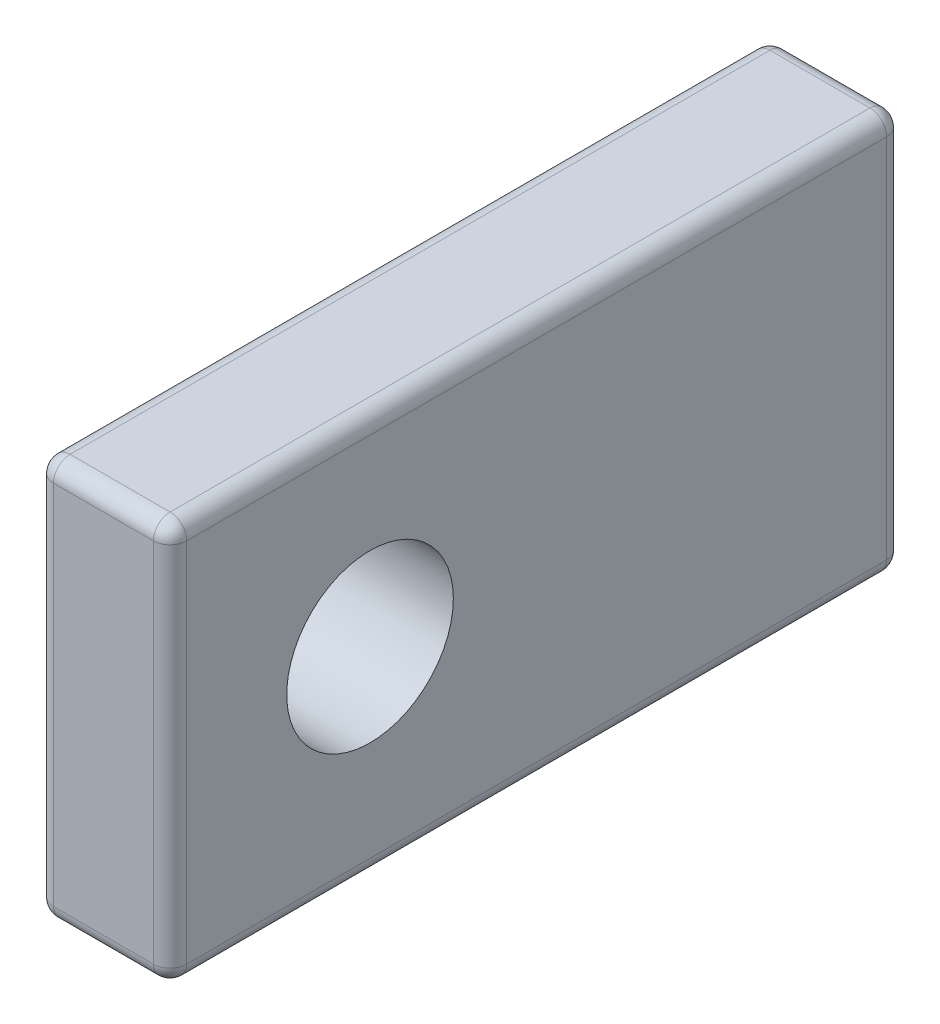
ISO-10303-21;
HEADER;
FILE_DESCRIPTION(('STEP AP214'),'2;1');
FILE_NAME('part.step','',(''),(''),'','','');
FILE_SCHEMA(('AUTOMOTIVE_DESIGN { 1 0 10303 214 1 1 1 1 }'));
ENDSEC;
DATA;
#1=APPLICATION_CONTEXT('core data for automotive mechanical design processes');
#2=APPLICATION_PROTOCOL_DEFINITION('international standard','automotive_design',2000,#1);
#3=PRODUCT_CONTEXT('',#1,'mechanical');
#4=PRODUCT('Part','Part','',(#3));
#5=PRODUCT_RELATED_PRODUCT_CATEGORY('part','',(#4));
#6=PRODUCT_DEFINITION_FORMATION('','',#4);
#7=PRODUCT_DEFINITION_CONTEXT('part definition',#1,'design');
#8=PRODUCT_DEFINITION('design','',#6,#7);
#9=PRODUCT_DEFINITION_SHAPE('','',#8);
#10=(LENGTH_UNIT() NAMED_UNIT(*) SI_UNIT(.MILLI.,.METRE.));
#11=(NAMED_UNIT(*) PLANE_ANGLE_UNIT() SI_UNIT($,.RADIAN.));
#12=(NAMED_UNIT(*) SI_UNIT($,.STERADIAN.) SOLID_ANGLE_UNIT());
#13=UNCERTAINTY_MEASURE_WITH_UNIT(LENGTH_MEASURE(1.E-05),#10,'distance_accuracy_value','');
#14=(GEOMETRIC_REPRESENTATION_CONTEXT(3) GLOBAL_UNCERTAINTY_ASSIGNED_CONTEXT((#13)) GLOBAL_UNIT_ASSIGNED_CONTEXT((#10,
#11,#12)) REPRESENTATION_CONTEXT('',''));
#15=CARTESIAN_POINT('',(0.,0.,0.));
#16=DIRECTION('',(0.,0.,1.));
#17=DIRECTION('',(1.,0.,0.));
#18=AXIS2_PLACEMENT_3D('',#15,#16,#17);
#19=CARTESIAN_POINT('',(3.17500000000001,-9.525,9.52499999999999));
#20=DIRECTION('',(1.,0.,0.));
#21=DIRECTION('',(0.,0.,-1.));
#22=AXIS2_PLACEMENT_3D('',#19,#20,#21);
#23=PLANE('',#22);
#24=DIRECTION('',(0.,0.,-1.));
#25=VECTOR('',#24,1.);
#26=CARTESIAN_POINT('',(3.17500000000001,-8.73125000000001,-25.4));
#27=LINE('',#26,#25);
#28=CARTESIAN_POINT('',(3.17500000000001,-8.73125,8.73125));
#29=VERTEX_POINT('',#28);
#30=CARTESIAN_POINT('',(3.17500000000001,-8.73125000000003,-24.6062500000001));
#31=VERTEX_POINT('',#30);
#32=EDGE_CURVE('E144',#29,#31,#27,.T.);
#33=ORIENTED_EDGE('',*,*,#32,.T.);
#34=DIRECTION('',(0.,1.,0.));
#35=VECTOR('',#34,1.);
#36=CARTESIAN_POINT('',(3.17500000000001,9.52500000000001,-24.6062500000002));
#37=LINE('',#36,#35);
#38=CARTESIAN_POINT('',(3.17500000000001,8.73125000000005,-24.6062500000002));
#39=VERTEX_POINT('',#38);
#40=EDGE_CURVE('E201',#31,#39,#37,.T.);
#41=ORIENTED_EDGE('',*,*,#40,.T.);
#42=DIRECTION('',(0.,0.,1.));
#43=VECTOR('',#42,1.);
#44=CARTESIAN_POINT('',(3.17500000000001,8.73125000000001,9.52500000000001));
#45=LINE('',#44,#43);
#46=CARTESIAN_POINT('',(3.17500000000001,8.73125000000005,8.73125));
#47=VERTEX_POINT('',#46);
#48=EDGE_CURVE('E196',#39,#47,#45,.T.);
#49=ORIENTED_EDGE('',*,*,#48,.T.);
#50=DIRECTION('',(0.,-1.,0.));
#51=VECTOR('',#50,1.);
#52=CARTESIAN_POINT('',(3.17500000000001,-9.52500000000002,8.73125000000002));
#53=LINE('',#52,#51);
#54=EDGE_CURVE('E198',#47,#29,#53,.T.);
#55=ORIENTED_EDGE('',*,*,#54,.T.);
#56=EDGE_LOOP('',(#33,#41,#49,#55));
#57=FACE_BOUND('',#56,.T.);
#58=CARTESIAN_POINT('',(3.17500000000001,0.,0.));
#59=DIRECTION('',(1.,0.,0.));
#60=DIRECTION('',(0.,0.,-1.));
#61=AXIS2_PLACEMENT_3D('',#58,#59,#60);
#62=CIRCLE('',#61,3.96875);
#63=CARTESIAN_POINT('',(3.17500000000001,0.,-3.96875000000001));
#64=VERTEX_POINT('',#63);
#65=EDGE_CURVE('E159',#64,#64,#62,.T.);
#66=ORIENTED_EDGE('',*,*,#65,.F.);
#67=EDGE_LOOP('',(#66));
#68=FACE_BOUND('',#67,.T.);
#69=ADVANCED_FACE('F38',(#57,#68),#23,.T.);
#70=CARTESIAN_POINT('',(-3.17500000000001,-9.525,9.52499999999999));
#71=DIRECTION('',(1.,0.,0.));
#72=DIRECTION('',(0.,0.,-1.));
#73=AXIS2_PLACEMENT_3D('',#70,#71,#72);
#74=PLANE('',#73);
#75=DIRECTION('',(0.,0.,1.));
#76=VECTOR('',#75,1.);
#77=CARTESIAN_POINT('',(-3.17500000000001,8.73125000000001,9.52500000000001));
#78=LINE('',#77,#76);
#79=CARTESIAN_POINT('',(-3.17500000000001,8.73125000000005,8.73125));
#80=VERTEX_POINT('',#79);
#81=CARTESIAN_POINT('',(-3.17500000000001,8.73125000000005,-24.6062500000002));
#82=VERTEX_POINT('',#81);
#83=EDGE_CURVE('E171',#80,#82,#78,.F.);
#84=ORIENTED_EDGE('',*,*,#83,.T.);
#85=DIRECTION('',(0.,1.,0.));
#86=VECTOR('',#85,1.);
#87=CARTESIAN_POINT('',(-3.17500000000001,-9.52500000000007,-24.6062500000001));
#88=LINE('',#87,#86);
#89=CARTESIAN_POINT('',(-3.17500000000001,-8.73125000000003,-24.6062500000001));
#90=VERTEX_POINT('',#89);
#91=EDGE_CURVE('E176',#82,#90,#88,.F.);
#92=ORIENTED_EDGE('',*,*,#91,.T.);
#93=DIRECTION('',(0.,0.,-1.));
#94=VECTOR('',#93,1.);
#95=CARTESIAN_POINT('',(-3.17500000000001,-8.73125000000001,9.52499999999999));
#96=LINE('',#95,#94);
#97=CARTESIAN_POINT('',(-3.17500000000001,-8.73125,8.73125));
#98=VERTEX_POINT('',#97);
#99=EDGE_CURVE('E173',#90,#98,#96,.F.);
#100=ORIENTED_EDGE('',*,*,#99,.T.);
#101=DIRECTION('',(0.,-1.,0.));
#102=VECTOR('',#101,1.);
#103=CARTESIAN_POINT('',(-3.17500000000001,-9.52500000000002,8.73125000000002));
#104=LINE('',#103,#102);
#105=EDGE_CURVE('E169',#98,#80,#104,.F.);
#106=ORIENTED_EDGE('',*,*,#105,.T.);
#107=EDGE_LOOP('',(#84,#92,#100,#106));
#108=FACE_BOUND('',#107,.T.);
#109=CARTESIAN_POINT('',(-3.17500000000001,0.,0.));
#110=DIRECTION('',(1.,0.,0.));
#111=DIRECTION('',(0.,0.,-1.));
#112=AXIS2_PLACEMENT_3D('',#109,#110,#111);
#113=CIRCLE('',#112,3.96875);
#114=CARTESIAN_POINT('',(-3.17500000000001,0.,-3.96875000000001));
#115=VERTEX_POINT('',#114);
#116=EDGE_CURVE('E162',#115,#115,#113,.T.);
#117=ORIENTED_EDGE('',*,*,#116,.T.);
#118=EDGE_LOOP('',(#117));
#119=FACE_BOUND('',#118,.T.);
#120=ADVANCED_FACE('F270',(#108,#119),#74,.F.);
#121=CARTESIAN_POINT('',(3.17500000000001,9.52499999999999,9.52500000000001));
#122=DIRECTION('',(0.,0.,-1.));
#123=DIRECTION('',(0.,1.,0.));
#124=AXIS2_PLACEMENT_3D('',#121,#122,#123);
#125=PLANE('',#124);
#126=DIRECTION('',(0.,-1.,0.));
#127=VECTOR('',#126,1.);
#128=CARTESIAN_POINT('',(-2.38125,9.52499999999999,9.52500000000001));
#129=LINE('',#128,#127);
#130=CARTESIAN_POINT('',(-2.38125,8.73125000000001,9.52500000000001));
#131=VERTEX_POINT('',#130);
#132=CARTESIAN_POINT('',(-2.38125,-8.73125000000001,9.52499999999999));
#133=VERTEX_POINT('',#132);
#134=EDGE_CURVE('E47',#131,#133,#129,.T.);
#135=ORIENTED_EDGE('',*,*,#134,.T.);
#136=DIRECTION('',(-1.,0.,0.));
#137=VECTOR('',#136,1.);
#138=CARTESIAN_POINT('',(3.17500000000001,-8.73125000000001,9.52499999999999));
#139=LINE('',#138,#137);
#140=CARTESIAN_POINT('',(2.38125,-8.73125000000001,9.52499999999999));
#141=VERTEX_POINT('',#140);
#142=EDGE_CURVE('E11',#133,#141,#139,.F.);
#143=ORIENTED_EDGE('',*,*,#142,.T.);
#144=DIRECTION('',(0.,-1.,0.));
#145=VECTOR('',#144,1.);
#146=CARTESIAN_POINT('',(2.38125,9.52499999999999,9.52500000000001));
#147=LINE('',#146,#145);
#148=CARTESIAN_POINT('',(2.38125,8.73125000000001,9.52500000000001));
#149=VERTEX_POINT('',#148);
#150=EDGE_CURVE('E206',#141,#149,#147,.F.);
#151=ORIENTED_EDGE('',*,*,#150,.T.);
#152=DIRECTION('',(-1.,0.,0.));
#153=VECTOR('',#152,1.);
#154=CARTESIAN_POINT('',(3.17500000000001,8.73125000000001,9.52500000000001));
#155=LINE('',#154,#153);
#156=EDGE_CURVE('E204',#149,#131,#155,.T.);
#157=ORIENTED_EDGE('',*,*,#156,.T.);
#158=EDGE_LOOP('',(#135,#143,#151,#157));
#159=FACE_BOUND('',#158,.T.);
#160=ADVANCED_FACE('F292',(#159),#125,.F.);
#161=CARTESIAN_POINT('',(3.17500000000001,-9.525,9.52499999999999));
#162=DIRECTION('',(0.,1.,0.));
#163=DIRECTION('',(0.,0.,1.));
#164=AXIS2_PLACEMENT_3D('',#161,#162,#163);
#165=PLANE('',#164);
#166=DIRECTION('',(-1.,0.,0.));
#167=VECTOR('',#166,1.);
#168=CARTESIAN_POINT('',(3.17500000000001,-9.52500000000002,8.73125000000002));
#169=LINE('',#168,#167);
#170=CARTESIAN_POINT('',(2.38125,-9.52500000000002,8.73125000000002));
#171=VERTEX_POINT('',#170);
#172=CARTESIAN_POINT('',(-2.38125,-9.52500000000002,8.73125000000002));
#173=VERTEX_POINT('',#172);
#174=EDGE_CURVE('E132',#171,#173,#169,.T.);
#175=ORIENTED_EDGE('',*,*,#174,.T.);
#176=DIRECTION('',(0.,0.,-1.));
#177=VECTOR('',#176,1.);
#178=CARTESIAN_POINT('',(-2.38125,-9.525,9.52499999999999));
#179=LINE('',#178,#177);
#180=CARTESIAN_POINT('',(-2.38125,-9.52500000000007,-24.6062500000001));
#181=VERTEX_POINT('',#180);
#182=EDGE_CURVE('E167',#173,#181,#179,.T.);
#183=ORIENTED_EDGE('',*,*,#182,.T.);
#184=DIRECTION('',(-1.,0.,0.));
#185=VECTOR('',#184,1.);
#186=CARTESIAN_POINT('',(3.17500000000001,-9.52500000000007,-24.6062500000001));
#187=LINE('',#186,#185);
#188=CARTESIAN_POINT('',(2.38125,-9.52500000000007,-24.6062500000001));
#189=VERTEX_POINT('',#188);
#190=EDGE_CURVE('E135',#181,#189,#187,.F.);
#191=ORIENTED_EDGE('',*,*,#190,.T.);
#192=DIRECTION('',(0.,0.,-1.));
#193=VECTOR('',#192,1.);
#194=CARTESIAN_POINT('',(2.38125,-9.525,9.52499999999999));
#195=LINE('',#194,#193);
#196=EDGE_CURVE('E128',#189,#171,#195,.F.);
#197=ORIENTED_EDGE('',*,*,#196,.T.);
#198=EDGE_LOOP('',(#175,#183,#191,#197));
#199=FACE_BOUND('',#198,.T.);
#200=ADVANCED_FACE('F130',(#199),#165,.F.);
#201=CARTESIAN_POINT('',(3.17500000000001,9.52500000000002,-25.4000000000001));
#202=DIRECTION('',(0.,0.,1.));
#203=DIRECTION('',(0.,-1.,0.));
#204=AXIS2_PLACEMENT_3D('',#201,#202,#203);
#205=PLANE('',#204);
#206=DIRECTION('',(-1.,0.,0.));
#207=VECTOR('',#206,1.);
#208=CARTESIAN_POINT('',(3.17500000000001,-8.73125000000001,-25.4));
#209=LINE('',#208,#207);
#210=CARTESIAN_POINT('',(2.38125,-8.73125000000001,-25.4));
#211=VERTEX_POINT('',#210);
#212=CARTESIAN_POINT('',(-2.38125,-8.73125000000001,-25.4));
#213=VERTEX_POINT('',#212);
#214=EDGE_CURVE('E182',#211,#213,#209,.T.);
#215=ORIENTED_EDGE('',*,*,#214,.T.);
#216=DIRECTION('',(0.,1.,0.));
#217=VECTOR('',#216,1.);
#218=CARTESIAN_POINT('',(-2.38125,9.52500000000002,-25.4000000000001));
#219=LINE('',#218,#217);
#220=CARTESIAN_POINT('',(-2.38125,8.73125000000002,-25.4000000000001));
#221=VERTEX_POINT('',#220);
#222=EDGE_CURVE('E185',#213,#221,#219,.T.);
#223=ORIENTED_EDGE('',*,*,#222,.T.);
#224=DIRECTION('',(-1.,0.,0.));
#225=VECTOR('',#224,1.);
#226=CARTESIAN_POINT('',(3.17500000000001,8.73125000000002,-25.4000000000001));
#227=LINE('',#226,#225);
#228=CARTESIAN_POINT('',(2.38125,8.73125000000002,-25.4000000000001));
#229=VERTEX_POINT('',#228);
#230=EDGE_CURVE('E180',#221,#229,#227,.F.);
#231=ORIENTED_EDGE('',*,*,#230,.T.);
#232=DIRECTION('',(0.,1.,0.));
#233=VECTOR('',#232,1.);
#234=CARTESIAN_POINT('',(2.38125,-9.52500000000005,-25.4));
#235=LINE('',#234,#233);
#236=EDGE_CURVE('E178',#229,#211,#235,.F.);
#237=ORIENTED_EDGE('',*,*,#236,.T.);
#238=EDGE_LOOP('',(#215,#223,#231,#237));
#239=FACE_BOUND('',#238,.T.);
#240=ADVANCED_FACE('F283',(#239),#205,.F.);
#241=CARTESIAN_POINT('',(3.17500000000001,9.52499999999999,9.52500000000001));
#242=DIRECTION('',(0.,-1.,0.));
#243=DIRECTION('',(0.,0.,-1.));
#244=AXIS2_PLACEMENT_3D('',#241,#242,#243);
#245=PLANE('',#244);
#246=DIRECTION('',(0.,0.,1.));
#247=VECTOR('',#246,1.);
#248=CARTESIAN_POINT('',(2.38125,9.52500000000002,-25.4000000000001));
#249=LINE('',#248,#247);
#250=CARTESIAN_POINT('',(2.38125,9.52500000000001,8.7312499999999));
#251=VERTEX_POINT('',#250);
#252=CARTESIAN_POINT('',(2.38125,9.52500000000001,-24.6062500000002));
#253=VERTEX_POINT('',#252);
#254=EDGE_CURVE('E187',#251,#253,#249,.F.);
#255=ORIENTED_EDGE('',*,*,#254,.T.);
#256=DIRECTION('',(-1.,0.,0.));
#257=VECTOR('',#256,1.);
#258=CARTESIAN_POINT('',(3.17500000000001,9.52500000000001,-24.6062500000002));
#259=LINE('',#258,#257);
#260=CARTESIAN_POINT('',(-2.38125,9.52500000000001,-24.6062500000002));
#261=VERTEX_POINT('',#260);
#262=EDGE_CURVE('E193',#253,#261,#259,.T.);
#263=ORIENTED_EDGE('',*,*,#262,.T.);
#264=DIRECTION('',(0.,0.,1.));
#265=VECTOR('',#264,1.);
#266=CARTESIAN_POINT('',(-2.38125,9.52499999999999,9.52500000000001));
#267=LINE('',#266,#265);
#268=CARTESIAN_POINT('',(-2.38125,9.52500000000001,8.7312499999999));
#269=VERTEX_POINT('',#268);
#270=EDGE_CURVE('E191',#261,#269,#267,.T.);
#271=ORIENTED_EDGE('',*,*,#270,.T.);
#272=DIRECTION('',(-1.,0.,0.));
#273=VECTOR('',#272,1.);
#274=CARTESIAN_POINT('',(3.17500000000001,9.52500000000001,8.7312499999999));
#275=LINE('',#274,#273);
#276=EDGE_CURVE('E189',#269,#251,#275,.F.);
#277=ORIENTED_EDGE('',*,*,#276,.T.);
#278=EDGE_LOOP('',(#255,#263,#271,#277));
#279=FACE_BOUND('',#278,.T.);
#280=ADVANCED_FACE('F274',(#279),#245,.F.);
#281=CARTESIAN_POINT('',(3.17500000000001,0.,0.));
#282=DIRECTION('',(-1.,0.,0.));
#283=DIRECTION('',(0.,0.,1.));
#284=AXIS2_PLACEMENT_3D('',#281,#282,#283);
#285=CYLINDRICAL_SURFACE('',#284,3.96875);
#286=ORIENTED_EDGE('',*,*,#65,.T.);
#287=EDGE_LOOP('',(#286));
#288=FACE_BOUND('',#287,.T.);
#289=ORIENTED_EDGE('',*,*,#116,.F.);
#290=EDGE_LOOP('',(#289));
#291=FACE_BOUND('',#290,.T.);
#292=ADVANCED_FACE('F272',(#288,#291),#285,.F.);
#293=CARTESIAN_POINT('',(2.38125,8.73125000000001,9.52500000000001));
#294=DIRECTION('',(0.,0.,-1.));
#295=DIRECTION('',(0.,1.,0.));
#296=AXIS2_PLACEMENT_3D('',#293,#294,#295);
#297=CYLINDRICAL_SURFACE('',#296,0.79375);
#298=CARTESIAN_POINT('',(2.38125,8.73125000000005,8.73125));
#299=DIRECTION('',(0.,0.,1.));
#300=DIRECTION('',(1.,0.,0.));
#301=AXIS2_PLACEMENT_3D('',#298,#299,#300);
#302=CIRCLE('',#301,0.79375);
#303=EDGE_CURVE('E42',#47,#251,#302,.T.);
#304=ORIENTED_EDGE('',*,*,#303,.F.);
#305=ORIENTED_EDGE('',*,*,#48,.F.);
#306=CARTESIAN_POINT('',(2.38125,8.73125000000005,-24.6062500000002));
#307=DIRECTION('',(0.,0.,-1.));
#308=DIRECTION('',(-1.,0.,0.));
#309=AXIS2_PLACEMENT_3D('',#306,#307,#308);
#310=CIRCLE('',#309,0.79375);
#311=EDGE_CURVE('E255',#253,#39,#310,.T.);
#312=ORIENTED_EDGE('',*,*,#311,.F.);
#313=ORIENTED_EDGE('',*,*,#254,.F.);
#314=EDGE_LOOP('',(#304,#305,#312,#313));
#315=FACE_BOUND('',#314,.T.);
#316=ADVANCED_FACE('F40',(#315),#297,.T.);
#317=CARTESIAN_POINT('',(2.38125,8.73125000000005,8.73125));
#318=DIRECTION('',(0.,0.,1.));
#319=DIRECTION('',(1.,0.,0.));
#320=AXIS2_PLACEMENT_3D('',#317,#318,#319);
#321=SPHERICAL_SURFACE('',#320,0.79375);
#322=CARTESIAN_POINT('',(2.38125,8.73125000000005,8.73125));
#323=DIRECTION('',(0.,1.,0.));
#324=DIRECTION('',(-1.,0.,0.));
#325=AXIS2_PLACEMENT_3D('',#322,#323,#324);
#326=CIRCLE('',#325,0.79375);
#327=EDGE_CURVE('E250',#47,#149,#326,.F.);
#328=ORIENTED_EDGE('',*,*,#327,.F.);
#329=ORIENTED_EDGE('',*,*,#303,.T.);
#330=CARTESIAN_POINT('',(2.38125,8.73125000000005,8.73125));
#331=DIRECTION('',(1.,0.,0.));
#332=DIRECTION('',(0.,0.,-1.));
#333=AXIS2_PLACEMENT_3D('',#330,#331,#332);
#334=CIRCLE('',#333,0.79375);
#335=EDGE_CURVE('E253',#149,#251,#334,.F.);
#336=ORIENTED_EDGE('',*,*,#335,.F.);
#337=EDGE_LOOP('',(#328,#329,#336));
#338=FACE_BOUND('',#337,.T.);
#339=ADVANCED_FACE('F281',(#338),#321,.T.);
#340=CARTESIAN_POINT('',(2.38125,8.73125000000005,-24.6062500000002));
#341=DIRECTION('',(0.,0.,1.));
#342=DIRECTION('',(1.,0.,0.));
#343=AXIS2_PLACEMENT_3D('',#340,#341,#342);
#344=SPHERICAL_SURFACE('',#343,0.79375);
#345=CARTESIAN_POINT('',(2.38125,8.73125000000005,-24.6062500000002));
#346=DIRECTION('',(1.,0.,0.));
#347=DIRECTION('',(0.,0.,-1.));
#348=AXIS2_PLACEMENT_3D('',#345,#346,#347);
#349=CIRCLE('',#348,0.79375);
#350=EDGE_CURVE('E245',#253,#229,#349,.F.);
#351=ORIENTED_EDGE('',*,*,#350,.F.);
#352=ORIENTED_EDGE('',*,*,#311,.T.);
#353=CARTESIAN_POINT('',(2.38125,8.73125000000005,-24.6062500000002));
#354=DIRECTION('',(0.,1.,0.));
#355=DIRECTION('',(0.,0.,1.));
#356=AXIS2_PLACEMENT_3D('',#353,#354,#355);
#357=CIRCLE('',#356,0.79375);
#358=EDGE_CURVE('E248',#229,#39,#357,.F.);
#359=ORIENTED_EDGE('',*,*,#358,.F.);
#360=EDGE_LOOP('',(#351,#352,#359));
#361=FACE_BOUND('',#360,.T.);
#362=ADVANCED_FACE('F365',(#361),#344,.T.);
#363=CARTESIAN_POINT('',(3.17500000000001,8.73125000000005,8.73125));
#364=DIRECTION('',(-1.,0.,0.));
#365=DIRECTION('',(0.,0.,1.));
#366=AXIS2_PLACEMENT_3D('',#363,#364,#365);
#367=CYLINDRICAL_SURFACE('',#366,0.79375);
#368=ORIENTED_EDGE('',*,*,#335,.T.);
#369=ORIENTED_EDGE('',*,*,#276,.F.);
#370=CARTESIAN_POINT('',(-2.38125,8.73125000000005,8.73125));
#371=DIRECTION('',(-1.,0.,0.));
#372=DIRECTION('',(0.,0.,1.));
#373=AXIS2_PLACEMENT_3D('',#370,#371,#372);
#374=CIRCLE('',#373,0.79375);
#375=EDGE_CURVE('E239',#131,#269,#374,.T.);
#376=ORIENTED_EDGE('',*,*,#375,.F.);
#377=ORIENTED_EDGE('',*,*,#156,.F.);
#378=EDGE_LOOP('',(#368,#369,#376,#377));
#379=FACE_BOUND('',#378,.T.);
#380=ADVANCED_FACE('F361',(#379),#367,.T.);
#381=CARTESIAN_POINT('',(2.38125,-9.52500000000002,8.73125000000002));
#382=DIRECTION('',(0.,1.,0.));
#383=DIRECTION('',(0.,0.,1.));
#384=AXIS2_PLACEMENT_3D('',#381,#382,#383);
#385=CYLINDRICAL_SURFACE('',#384,0.79375);
#386=ORIENTED_EDGE('',*,*,#327,.T.);
#387=ORIENTED_EDGE('',*,*,#150,.F.);
#388=CARTESIAN_POINT('',(2.38125,-8.73125,8.73125));
#389=DIRECTION('',(0.,-1.,0.));
#390=DIRECTION('',(0.,0.,-1.));
#391=AXIS2_PLACEMENT_3D('',#388,#389,#390);
#392=CIRCLE('',#391,0.79375);
#393=EDGE_CURVE('E147',#29,#141,#392,.T.);
#394=ORIENTED_EDGE('',*,*,#393,.F.);
#395=ORIENTED_EDGE('',*,*,#54,.F.);
#396=EDGE_LOOP('',(#386,#387,#394,#395));
#397=FACE_BOUND('',#396,.T.);
#398=ADVANCED_FACE('F358',(#397),#385,.T.);
#399=CARTESIAN_POINT('',(2.38125,-8.73125000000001,9.52499999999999));
#400=DIRECTION('',(0.,0.,1.));
#401=DIRECTION('',(1.,0.,0.));
#402=AXIS2_PLACEMENT_3D('',#399,#400,#401);
#403=CYLINDRICAL_SURFACE('',#402,0.79375);
#404=CARTESIAN_POINT('',(2.38125,-8.73125000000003,-24.6062500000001));
#405=DIRECTION('',(0.,0.,-1.));
#406=DIRECTION('',(0.,1.,0.));
#407=AXIS2_PLACEMENT_3D('',#404,#405,#406);
#408=CIRCLE('',#407,0.79375);
#409=EDGE_CURVE('E148',#31,#189,#408,.T.);
#410=ORIENTED_EDGE('',*,*,#409,.F.);
#411=ORIENTED_EDGE('',*,*,#32,.F.);
#412=CARTESIAN_POINT('',(2.38125,-8.73125,8.73125));
#413=DIRECTION('',(0.,0.,1.));
#414=DIRECTION('',(1.,0.,0.));
#415=AXIS2_PLACEMENT_3D('',#412,#413,#414);
#416=CIRCLE('',#415,0.79375);
#417=EDGE_CURVE('E142',#171,#29,#416,.T.);
#418=ORIENTED_EDGE('',*,*,#417,.F.);
#419=ORIENTED_EDGE('',*,*,#196,.F.);
#420=EDGE_LOOP('',(#410,#411,#418,#419));
#421=FACE_BOUND('',#420,.T.);
#422=ADVANCED_FACE('F143',(#421),#403,.T.);
#423=CARTESIAN_POINT('',(2.38125,-9.52500000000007,-24.6062500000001));
#424=DIRECTION('',(0.,-1.,0.));
#425=DIRECTION('',(0.,0.,-1.));
#426=AXIS2_PLACEMENT_3D('',#423,#424,#425);
#427=CYLINDRICAL_SURFACE('',#426,0.79375);
#428=ORIENTED_EDGE('',*,*,#358,.T.);
#429=ORIENTED_EDGE('',*,*,#40,.F.);
#430=CARTESIAN_POINT('',(2.38125,-8.73125000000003,-24.6062500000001));
#431=DIRECTION('',(0.,-1.,0.));
#432=DIRECTION('',(0.,0.,-1.));
#433=AXIS2_PLACEMENT_3D('',#430,#431,#432);
#434=CIRCLE('',#433,0.79375);
#435=EDGE_CURVE('E234',#211,#31,#434,.T.);
#436=ORIENTED_EDGE('',*,*,#435,.F.);
#437=ORIENTED_EDGE('',*,*,#236,.F.);
#438=EDGE_LOOP('',(#428,#429,#436,#437));
#439=FACE_BOUND('',#438,.T.);
#440=ADVANCED_FACE('F351',(#439),#427,.T.);
#441=CARTESIAN_POINT('',(3.17500000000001,8.73125000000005,-24.6062500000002));
#442=DIRECTION('',(-1.,0.,0.));
#443=DIRECTION('',(0.,0.,1.));
#444=AXIS2_PLACEMENT_3D('',#441,#442,#443);
#445=CYLINDRICAL_SURFACE('',#444,0.79375);
#446=ORIENTED_EDGE('',*,*,#350,.T.);
#447=ORIENTED_EDGE('',*,*,#230,.F.);
#448=CARTESIAN_POINT('',(-2.38125,8.73125000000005,-24.6062500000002));
#449=DIRECTION('',(-1.,0.,0.));
#450=DIRECTION('',(0.,0.,1.));
#451=AXIS2_PLACEMENT_3D('',#448,#449,#450);
#452=CIRCLE('',#451,0.79375);
#453=EDGE_CURVE('E231',#261,#221,#452,.T.);
#454=ORIENTED_EDGE('',*,*,#453,.F.);
#455=ORIENTED_EDGE('',*,*,#262,.F.);
#456=EDGE_LOOP('',(#446,#447,#454,#455));
#457=FACE_BOUND('',#456,.T.);
#458=ADVANCED_FACE('F347',(#457),#445,.T.);
#459=CARTESIAN_POINT('',(-2.38125,8.73125000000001,9.52500000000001));
#460=DIRECTION('',(0.,0.,1.));
#461=DIRECTION('',(0.,-1.,0.));
#462=AXIS2_PLACEMENT_3D('',#459,#460,#461);
#463=CYLINDRICAL_SURFACE('',#462,0.79375);
#464=CARTESIAN_POINT('',(-2.38125,8.73125000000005,8.73125));
#465=DIRECTION('',(0.,0.,1.));
#466=DIRECTION('',(1.,0.,0.));
#467=AXIS2_PLACEMENT_3D('',#464,#465,#466);
#468=CIRCLE('',#467,0.79375);
#469=EDGE_CURVE('E242',#269,#80,#468,.T.);
#470=ORIENTED_EDGE('',*,*,#469,.F.);
#471=ORIENTED_EDGE('',*,*,#270,.F.);
#472=CARTESIAN_POINT('',(-2.38125,8.73125000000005,-24.6062500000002));
#473=DIRECTION('',(0.,0.,-1.));
#474=DIRECTION('',(0.,1.,0.));
#475=AXIS2_PLACEMENT_3D('',#472,#473,#474);
#476=CIRCLE('',#475,0.79375);
#477=EDGE_CURVE('E229',#82,#261,#476,.T.);
#478=ORIENTED_EDGE('',*,*,#477,.F.);
#479=ORIENTED_EDGE('',*,*,#83,.F.);
#480=EDGE_LOOP('',(#470,#471,#478,#479));
#481=FACE_BOUND('',#480,.T.);
#482=ADVANCED_FACE('F343',(#481),#463,.T.);
#483=CARTESIAN_POINT('',(-2.38125,8.73125000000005,8.73125));
#484=DIRECTION('',(0.,0.,1.));
#485=DIRECTION('',(1.,0.,0.));
#486=AXIS2_PLACEMENT_3D('',#483,#484,#485);
#487=SPHERICAL_SURFACE('',#486,0.79375);
#488=ORIENTED_EDGE('',*,*,#375,.T.);
#489=ORIENTED_EDGE('',*,*,#469,.T.);
#490=CARTESIAN_POINT('',(-2.38125,8.73125000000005,8.73125));
#491=DIRECTION('',(0.,1.,0.));
#492=DIRECTION('',(0.,0.,1.));
#493=AXIS2_PLACEMENT_3D('',#490,#491,#492);
#494=CIRCLE('',#493,0.79375);
#495=EDGE_CURVE('E152',#131,#80,#494,.F.);
#496=ORIENTED_EDGE('',*,*,#495,.F.);
#497=EDGE_LOOP('',(#488,#489,#496));
#498=FACE_BOUND('',#497,.T.);
#499=ADVANCED_FACE('F340',(#498),#487,.T.);
#500=CARTESIAN_POINT('',(2.38125,-8.73125,8.73125));
#501=DIRECTION('',(0.,0.,1.));
#502=DIRECTION('',(1.,0.,0.));
#503=AXIS2_PLACEMENT_3D('',#500,#501,#502);
#504=SPHERICAL_SURFACE('',#503,0.79375);
#505=ORIENTED_EDGE('',*,*,#417,.T.);
#506=ORIENTED_EDGE('',*,*,#393,.T.);
#507=CARTESIAN_POINT('',(2.38125,-8.73125,8.73125));
#508=DIRECTION('',(1.,0.,0.));
#509=DIRECTION('',(0.,0.,-1.));
#510=AXIS2_PLACEMENT_3D('',#507,#508,#509);
#511=CIRCLE('',#510,0.79375);
#512=EDGE_CURVE('E60',#171,#141,#511,.F.);
#513=ORIENTED_EDGE('',*,*,#512,.F.);
#514=EDGE_LOOP('',(#505,#506,#513));
#515=FACE_BOUND('',#514,.T.);
#516=ADVANCED_FACE('F150',(#515),#504,.T.);
#517=CARTESIAN_POINT('',(2.38125,-8.73125000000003,-24.6062500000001));
#518=DIRECTION('',(0.,0.,1.));
#519=DIRECTION('',(1.,0.,0.));
#520=AXIS2_PLACEMENT_3D('',#517,#518,#519);
#521=SPHERICAL_SURFACE('',#520,0.79375);
#522=ORIENTED_EDGE('',*,*,#435,.T.);
#523=ORIENTED_EDGE('',*,*,#409,.T.);
#524=CARTESIAN_POINT('',(2.38125,-8.73125000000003,-24.6062500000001));
#525=DIRECTION('',(1.,0.,0.));
#526=DIRECTION('',(0.,0.,-1.));
#527=AXIS2_PLACEMENT_3D('',#524,#525,#526);
#528=CIRCLE('',#527,0.79375);
#529=EDGE_CURVE('E153',#211,#189,#528,.F.);
#530=ORIENTED_EDGE('',*,*,#529,.F.);
#531=EDGE_LOOP('',(#522,#523,#530));
#532=FACE_BOUND('',#531,.T.);
#533=ADVANCED_FACE('F333',(#532),#521,.T.);
#534=CARTESIAN_POINT('',(-2.38125,8.73125000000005,-24.6062500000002));
#535=DIRECTION('',(0.,0.,1.));
#536=DIRECTION('',(1.,0.,0.));
#537=AXIS2_PLACEMENT_3D('',#534,#535,#536);
#538=SPHERICAL_SURFACE('',#537,0.79375);
#539=ORIENTED_EDGE('',*,*,#477,.T.);
#540=ORIENTED_EDGE('',*,*,#453,.T.);
#541=CARTESIAN_POINT('',(-2.38125,8.73125000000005,-24.6062500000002));
#542=DIRECTION('',(0.,1.,0.));
#543=DIRECTION('',(0.,0.,1.));
#544=AXIS2_PLACEMENT_3D('',#541,#542,#543);
#545=CIRCLE('',#544,0.79375);
#546=EDGE_CURVE('E222',#82,#221,#545,.F.);
#547=ORIENTED_EDGE('',*,*,#546,.F.);
#548=EDGE_LOOP('',(#539,#540,#547));
#549=FACE_BOUND('',#548,.T.);
#550=ADVANCED_FACE('F329',(#549),#538,.T.);
#551=CARTESIAN_POINT('',(-2.38125,9.52500000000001,8.7312499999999));
#552=DIRECTION('',(0.,-1.,0.));
#553=DIRECTION('',(0.,0.,-1.));
#554=AXIS2_PLACEMENT_3D('',#551,#552,#553);
#555=CYLINDRICAL_SURFACE('',#554,0.79375);
#556=ORIENTED_EDGE('',*,*,#495,.T.);
#557=ORIENTED_EDGE('',*,*,#105,.F.);
#558=CARTESIAN_POINT('',(-2.38125,-8.73125,8.73125));
#559=DIRECTION('',(0.,-1.,0.));
#560=DIRECTION('',(0.,0.,-1.));
#561=AXIS2_PLACEMENT_3D('',#558,#559,#560);
#562=CIRCLE('',#561,0.79375);
#563=EDGE_CURVE('E219',#133,#98,#562,.T.);
#564=ORIENTED_EDGE('',*,*,#563,.F.);
#565=ORIENTED_EDGE('',*,*,#134,.F.);
#566=EDGE_LOOP('',(#556,#557,#564,#565));
#567=FACE_BOUND('',#566,.T.);
#568=ADVANCED_FACE('F326',(#567),#555,.T.);
#569=CARTESIAN_POINT('',(3.17500000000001,-8.73125,8.73125));
#570=DIRECTION('',(-1.,0.,0.));
#571=DIRECTION('',(0.,0.,1.));
#572=AXIS2_PLACEMENT_3D('',#569,#570,#571);
#573=CYLINDRICAL_SURFACE('',#572,0.79375);
#574=ORIENTED_EDGE('',*,*,#512,.T.);
#575=ORIENTED_EDGE('',*,*,#142,.F.);
#576=CARTESIAN_POINT('',(-2.38125,-8.73125,8.73125));
#577=DIRECTION('',(-1.,0.,0.));
#578=DIRECTION('',(0.,0.,1.));
#579=AXIS2_PLACEMENT_3D('',#576,#577,#578);
#580=CIRCLE('',#579,0.79375);
#581=EDGE_CURVE('E157',#173,#133,#580,.T.);
#582=ORIENTED_EDGE('',*,*,#581,.F.);
#583=ORIENTED_EDGE('',*,*,#174,.F.);
#584=EDGE_LOOP('',(#574,#575,#582,#583));
#585=FACE_BOUND('',#584,.T.);
#586=ADVANCED_FACE('F155',(#585),#573,.T.);
#587=CARTESIAN_POINT('',(3.17500000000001,-8.73125000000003,-24.6062500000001));
#588=DIRECTION('',(-1.,0.,0.));
#589=DIRECTION('',(0.,0.,1.));
#590=AXIS2_PLACEMENT_3D('',#587,#588,#589);
#591=CYLINDRICAL_SURFACE('',#590,0.79375);
#592=ORIENTED_EDGE('',*,*,#529,.T.);
#593=ORIENTED_EDGE('',*,*,#190,.F.);
#594=CARTESIAN_POINT('',(-2.38125,-8.73125000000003,-24.6062500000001));
#595=DIRECTION('',(-1.,0.,0.));
#596=DIRECTION('',(0.,0.,1.));
#597=AXIS2_PLACEMENT_3D('',#594,#595,#596);
#598=CIRCLE('',#597,0.79375);
#599=EDGE_CURVE('E215',#213,#181,#598,.T.);
#600=ORIENTED_EDGE('',*,*,#599,.F.);
#601=ORIENTED_EDGE('',*,*,#214,.F.);
#602=EDGE_LOOP('',(#592,#593,#600,#601));
#603=FACE_BOUND('',#602,.T.);
#604=ADVANCED_FACE('F319',(#603),#591,.T.);
#605=CARTESIAN_POINT('',(-2.38125,9.52500000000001,-24.6062500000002));
#606=DIRECTION('',(0.,1.,0.));
#607=DIRECTION('',(0.,0.,1.));
#608=AXIS2_PLACEMENT_3D('',#605,#606,#607);
#609=CYLINDRICAL_SURFACE('',#608,0.79375);
#610=ORIENTED_EDGE('',*,*,#546,.T.);
#611=ORIENTED_EDGE('',*,*,#222,.F.);
#612=CARTESIAN_POINT('',(-2.38125,-8.73125000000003,-24.6062500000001));
#613=DIRECTION('',(0.,-1.,0.));
#614=DIRECTION('',(0.,0.,-1.));
#615=AXIS2_PLACEMENT_3D('',#612,#613,#614);
#616=CIRCLE('',#615,0.79375);
#617=EDGE_CURVE('E213',#90,#213,#616,.T.);
#618=ORIENTED_EDGE('',*,*,#617,.F.);
#619=ORIENTED_EDGE('',*,*,#91,.F.);
#620=EDGE_LOOP('',(#610,#611,#618,#619));
#621=FACE_BOUND('',#620,.T.);
#622=ADVANCED_FACE('F315',(#621),#609,.T.);
#623=CARTESIAN_POINT('',(-2.38125,-8.73125,8.73125));
#624=DIRECTION('',(0.,0.,1.));
#625=DIRECTION('',(1.,0.,0.));
#626=AXIS2_PLACEMENT_3D('',#623,#624,#625);
#627=SPHERICAL_SURFACE('',#626,0.79375);
#628=ORIENTED_EDGE('',*,*,#581,.T.);
#629=ORIENTED_EDGE('',*,*,#563,.T.);
#630=CARTESIAN_POINT('',(-2.38125,-8.73125,8.73125));
#631=DIRECTION('',(0.,0.,1.));
#632=DIRECTION('',(1.,0.,0.));
#633=AXIS2_PLACEMENT_3D('',#630,#631,#632);
#634=CIRCLE('',#633,0.79375);
#635=EDGE_CURVE('E211',#173,#98,#634,.F.);
#636=ORIENTED_EDGE('',*,*,#635,.F.);
#637=EDGE_LOOP('',(#628,#629,#636));
#638=FACE_BOUND('',#637,.T.);
#639=ADVANCED_FACE('F311',(#638),#627,.T.);
#640=CARTESIAN_POINT('',(-2.38125,-8.73125000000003,-24.6062500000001));
#641=DIRECTION('',(0.,0.,1.));
#642=DIRECTION('',(1.,0.,0.));
#643=AXIS2_PLACEMENT_3D('',#640,#641,#642);
#644=SPHERICAL_SURFACE('',#643,0.79375);
#645=ORIENTED_EDGE('',*,*,#617,.T.);
#646=ORIENTED_EDGE('',*,*,#599,.T.);
#647=CARTESIAN_POINT('',(-2.38125,-8.73125000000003,-24.6062500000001));
#648=DIRECTION('',(0.,0.,-1.));
#649=DIRECTION('',(-1.,0.,0.));
#650=AXIS2_PLACEMENT_3D('',#647,#648,#649);
#651=CIRCLE('',#650,0.79375);
#652=EDGE_CURVE('E209',#90,#181,#651,.F.);
#653=ORIENTED_EDGE('',*,*,#652,.F.);
#654=EDGE_LOOP('',(#645,#646,#653));
#655=FACE_BOUND('',#654,.T.);
#656=ADVANCED_FACE('F307',(#655),#644,.T.);
#657=CARTESIAN_POINT('',(-2.38125,-8.73125000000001,9.52499999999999));
#658=DIRECTION('',(0.,0.,-1.));
#659=DIRECTION('',(-1.,0.,0.));
#660=AXIS2_PLACEMENT_3D('',#657,#658,#659);
#661=CYLINDRICAL_SURFACE('',#660,0.79375);
#662=ORIENTED_EDGE('',*,*,#635,.T.);
#663=ORIENTED_EDGE('',*,*,#99,.F.);
#664=ORIENTED_EDGE('',*,*,#652,.T.);
#665=ORIENTED_EDGE('',*,*,#182,.F.);
#666=EDGE_LOOP('',(#662,#663,#664,#665));
#667=FACE_BOUND('',#666,.T.);
#668=ADVANCED_FACE('F304',(#667),#661,.T.);
#669=CLOSED_SHELL('',(#69,#120,#160,#200,#240,#280,#292,#316,#339,#362,#380,#398,#422,#440,#458,
#482,#499,#516,#533,#550,#568,#586,#604,#622,#639,#656,#668));
#670=MANIFOLD_SOLID_BREP('B2',#669);
#671=ADVANCED_BREP_SHAPE_REPRESENTATION('',(#18,#670),#14);
#672=SHAPE_DEFINITION_REPRESENTATION(#9,#671);
ENDSEC;
END-ISO-10303-21;
